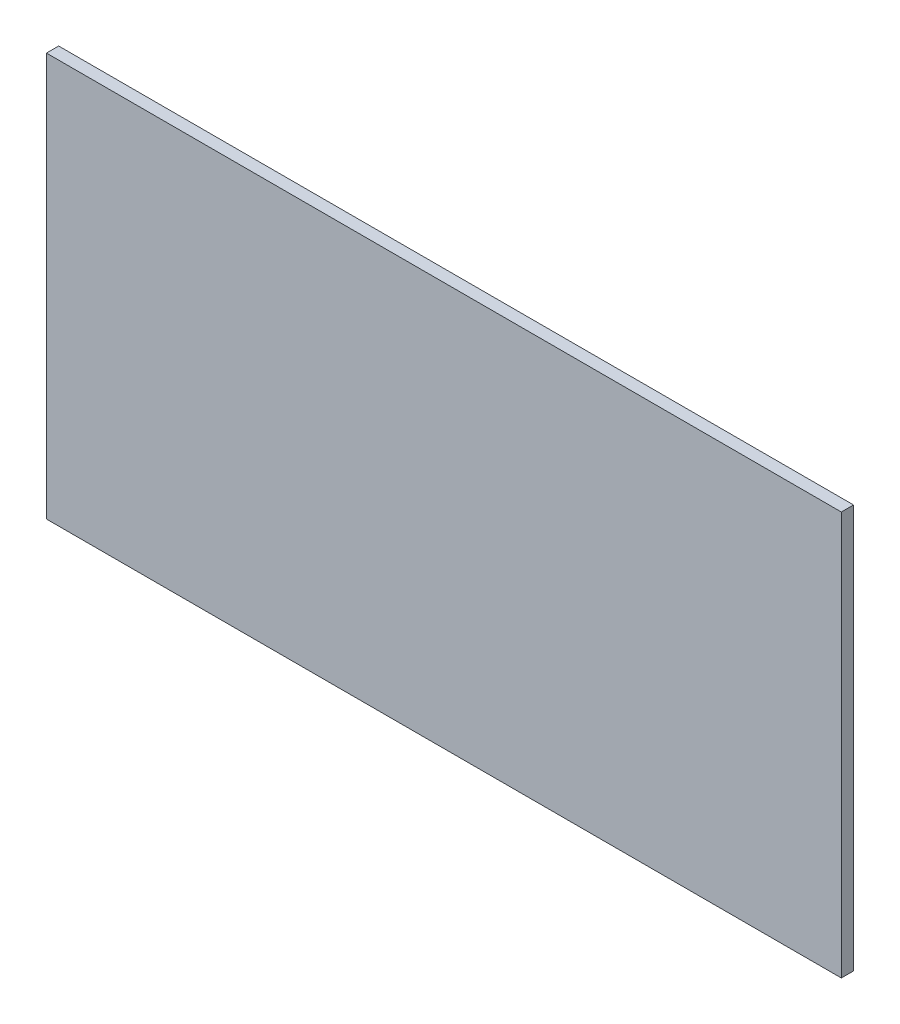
ISO-10303-21;
HEADER;
FILE_DESCRIPTION(('STEP AP214'),'2;1');
FILE_NAME('part.step','',(''),(''),'','','');
FILE_SCHEMA(('AUTOMOTIVE_DESIGN { 1 0 10303 214 1 1 1 1 }'));
ENDSEC;
DATA;
#1=APPLICATION_CONTEXT('core data for automotive mechanical design processes');
#2=APPLICATION_PROTOCOL_DEFINITION('international standard','automotive_design',2000,#1);
#3=PRODUCT_CONTEXT('',#1,'mechanical');
#4=PRODUCT('Part','Part','',(#3));
#5=PRODUCT_RELATED_PRODUCT_CATEGORY('part','',(#4));
#6=PRODUCT_DEFINITION_FORMATION('','',#4);
#7=PRODUCT_DEFINITION_CONTEXT('part definition',#1,'design');
#8=PRODUCT_DEFINITION('design','',#6,#7);
#9=PRODUCT_DEFINITION_SHAPE('','',#8);
#10=(LENGTH_UNIT() NAMED_UNIT(*) SI_UNIT(.MILLI.,.METRE.));
#11=(NAMED_UNIT(*) PLANE_ANGLE_UNIT() SI_UNIT($,.RADIAN.));
#12=(NAMED_UNIT(*) SI_UNIT($,.STERADIAN.) SOLID_ANGLE_UNIT());
#13=UNCERTAINTY_MEASURE_WITH_UNIT(LENGTH_MEASURE(1.E-05),#10,'distance_accuracy_value','');
#14=(GEOMETRIC_REPRESENTATION_CONTEXT(3) GLOBAL_UNCERTAINTY_ASSIGNED_CONTEXT((#13)) GLOBAL_UNIT_ASSIGNED_CONTEXT((#10,
#11,#12)) REPRESENTATION_CONTEXT('',''));
#15=CARTESIAN_POINT('',(0.,0.,0.));
#16=DIRECTION('',(0.,0.,1.));
#17=DIRECTION('',(1.,0.,0.));
#18=AXIS2_PLACEMENT_3D('',#15,#16,#17);
#19=CARTESIAN_POINT('',(412.75,-209.55,6.35));
#20=DIRECTION('',(-1.,0.,0.));
#21=DIRECTION('',(0.,0.,1.));
#22=AXIS2_PLACEMENT_3D('',#19,#20,#21);
#23=PLANE('',#22);
#24=DIRECTION('',(0.,1.,0.));
#25=VECTOR('',#24,1.);
#26=CARTESIAN_POINT('',(412.75,-209.55,-6.35));
#27=LINE('',#26,#25);
#28=CARTESIAN_POINT('',(412.75,-209.55,-6.35));
#29=VERTEX_POINT('',#28);
#30=CARTESIAN_POINT('',(412.75,209.55,-6.35));
#31=VERTEX_POINT('',#30);
#32=EDGE_CURVE('E93',#29,#31,#27,.T.);
#33=ORIENTED_EDGE('',*,*,#32,.T.);
#34=DIRECTION('',(0.,0.,-1.));
#35=VECTOR('',#34,1.);
#36=CARTESIAN_POINT('',(412.75,209.55,6.35));
#37=LINE('',#36,#35);
#38=CARTESIAN_POINT('',(412.75,209.55,6.35));
#39=VERTEX_POINT('',#38);
#40=EDGE_CURVE('E11',#39,#31,#37,.T.);
#41=ORIENTED_EDGE('',*,*,#40,.F.);
#42=DIRECTION('',(0.,1.,0.));
#43=VECTOR('',#42,1.);
#44=CARTESIAN_POINT('',(412.75,-209.55,6.35));
#45=LINE('',#44,#43);
#46=CARTESIAN_POINT('',(412.75,-209.55,6.35));
#47=VERTEX_POINT('',#46);
#48=EDGE_CURVE('E81',#47,#39,#45,.T.);
#49=ORIENTED_EDGE('',*,*,#48,.F.);
#50=DIRECTION('',(0.,0.,-1.));
#51=VECTOR('',#50,1.);
#52=CARTESIAN_POINT('',(412.75,-209.55,6.35));
#53=LINE('',#52,#51);
#54=EDGE_CURVE('E89',#47,#29,#53,.T.);
#55=ORIENTED_EDGE('',*,*,#54,.T.);
#56=EDGE_LOOP('',(#33,#41,#49,#55));
#57=FACE_BOUND('',#56,.T.);
#58=ADVANCED_FACE('F30',(#57),#23,.F.);
#59=CARTESIAN_POINT('',(-412.75,209.55,6.35));
#60=DIRECTION('',(0.,-1.,0.));
#61=DIRECTION('',(0.,0.,-1.));
#62=AXIS2_PLACEMENT_3D('',#59,#60,#61);
#63=PLANE('',#62);
#64=DIRECTION('',(-1.,0.,0.));
#65=VECTOR('',#64,1.);
#66=CARTESIAN_POINT('',(-412.75,209.55,-6.35));
#67=LINE('',#66,#65);
#68=CARTESIAN_POINT('',(-412.75,209.55,-6.35));
#69=VERTEX_POINT('',#68);
#70=EDGE_CURVE('E85',#31,#69,#67,.T.);
#71=ORIENTED_EDGE('',*,*,#70,.T.);
#72=DIRECTION('',(0.,0.,-1.));
#73=VECTOR('',#72,1.);
#74=CARTESIAN_POINT('',(-412.75,209.55,6.35));
#75=LINE('',#74,#73);
#76=CARTESIAN_POINT('',(-412.75,209.55,6.35));
#77=VERTEX_POINT('',#76);
#78=EDGE_CURVE('E38',#77,#69,#75,.T.);
#79=ORIENTED_EDGE('',*,*,#78,.F.);
#80=DIRECTION('',(-1.,0.,0.));
#81=VECTOR('',#80,1.);
#82=CARTESIAN_POINT('',(-412.75,209.55,6.35));
#83=LINE('',#82,#81);
#84=EDGE_CURVE('E76',#39,#77,#83,.T.);
#85=ORIENTED_EDGE('',*,*,#84,.F.);
#86=ORIENTED_EDGE('',*,*,#40,.T.);
#87=EDGE_LOOP('',(#71,#79,#85,#86));
#88=FACE_BOUND('',#87,.T.);
#89=ADVANCED_FACE('F84',(#88),#63,.F.);
#90=CARTESIAN_POINT('',(-412.75,-209.55,6.35));
#91=DIRECTION('',(1.,0.,0.));
#92=DIRECTION('',(0.,0.,-1.));
#93=AXIS2_PLACEMENT_3D('',#90,#91,#92);
#94=PLANE('',#93);
#95=DIRECTION('',(0.,-1.,0.));
#96=VECTOR('',#95,1.);
#97=CARTESIAN_POINT('',(-412.75,-209.55,-6.35));
#98=LINE('',#97,#96);
#99=CARTESIAN_POINT('',(-412.75,-209.55,-6.35));
#100=VERTEX_POINT('',#99);
#101=EDGE_CURVE('E63',#69,#100,#98,.T.);
#102=ORIENTED_EDGE('',*,*,#101,.T.);
#103=DIRECTION('',(0.,0.,-1.));
#104=VECTOR('',#103,1.);
#105=CARTESIAN_POINT('',(-412.75,-209.55,6.35));
#106=LINE('',#105,#104);
#107=CARTESIAN_POINT('',(-412.75,-209.55,6.35));
#108=VERTEX_POINT('',#107);
#109=EDGE_CURVE('E86',#108,#100,#106,.T.);
#110=ORIENTED_EDGE('',*,*,#109,.F.);
#111=DIRECTION('',(0.,-1.,0.));
#112=VECTOR('',#111,1.);
#113=CARTESIAN_POINT('',(-412.75,-209.55,6.35));
#114=LINE('',#113,#112);
#115=EDGE_CURVE('E79',#77,#108,#114,.T.);
#116=ORIENTED_EDGE('',*,*,#115,.F.);
#117=ORIENTED_EDGE('',*,*,#78,.T.);
#118=EDGE_LOOP('',(#102,#110,#116,#117));
#119=FACE_BOUND('',#118,.T.);
#120=ADVANCED_FACE('F87',(#119),#94,.F.);
#121=CARTESIAN_POINT('',(-412.75,-209.55,6.35));
#122=DIRECTION('',(0.,1.,0.));
#123=DIRECTION('',(0.,0.,1.));
#124=AXIS2_PLACEMENT_3D('',#121,#122,#123);
#125=PLANE('',#124);
#126=DIRECTION('',(1.,0.,0.));
#127=VECTOR('',#126,1.);
#128=CARTESIAN_POINT('',(-412.75,-209.55,-6.35));
#129=LINE('',#128,#127);
#130=EDGE_CURVE('E69',#100,#29,#129,.T.);
#131=ORIENTED_EDGE('',*,*,#130,.T.);
#132=ORIENTED_EDGE('',*,*,#54,.F.);
#133=DIRECTION('',(1.,0.,0.));
#134=VECTOR('',#133,1.);
#135=CARTESIAN_POINT('',(-412.75,-209.55,6.35));
#136=LINE('',#135,#134);
#137=EDGE_CURVE('E46',#108,#47,#136,.T.);
#138=ORIENTED_EDGE('',*,*,#137,.F.);
#139=ORIENTED_EDGE('',*,*,#109,.T.);
#140=EDGE_LOOP('',(#131,#132,#138,#139));
#141=FACE_BOUND('',#140,.T.);
#142=ADVANCED_FACE('F100',(#141),#125,.F.);
#143=CARTESIAN_POINT('',(412.75,209.55,6.35));
#144=DIRECTION('',(0.,0.,-1.));
#145=DIRECTION('',(-1.,0.,0.));
#146=AXIS2_PLACEMENT_3D('',#143,#144,#145);
#147=PLANE('',#146);
#148=ORIENTED_EDGE('',*,*,#48,.T.);
#149=ORIENTED_EDGE('',*,*,#84,.T.);
#150=ORIENTED_EDGE('',*,*,#115,.T.);
#151=ORIENTED_EDGE('',*,*,#137,.T.);
#152=EDGE_LOOP('',(#148,#149,#150,#151));
#153=FACE_BOUND('',#152,.T.);
#154=ADVANCED_FACE('F77',(#153),#147,.F.);
#155=CARTESIAN_POINT('',(412.75,209.55,-6.35));
#156=DIRECTION('',(0.,0.,-1.));
#157=DIRECTION('',(-1.,0.,0.));
#158=AXIS2_PLACEMENT_3D('',#155,#156,#157);
#159=PLANE('',#158);
#160=ORIENTED_EDGE('',*,*,#32,.F.);
#161=ORIENTED_EDGE('',*,*,#130,.F.);
#162=ORIENTED_EDGE('',*,*,#101,.F.);
#163=ORIENTED_EDGE('',*,*,#70,.F.);
#164=EDGE_LOOP('',(#160,#161,#162,#163));
#165=FACE_BOUND('',#164,.T.);
#166=ADVANCED_FACE('F103',(#165),#159,.T.);
#167=CLOSED_SHELL('',(#58,#89,#120,#142,#154,#166));
#168=MANIFOLD_SOLID_BREP('B2',#167);
#169=ADVANCED_BREP_SHAPE_REPRESENTATION('',(#18,#168),#14);
#170=SHAPE_DEFINITION_REPRESENTATION(#9,#169);
ENDSEC;
END-ISO-10303-21;
